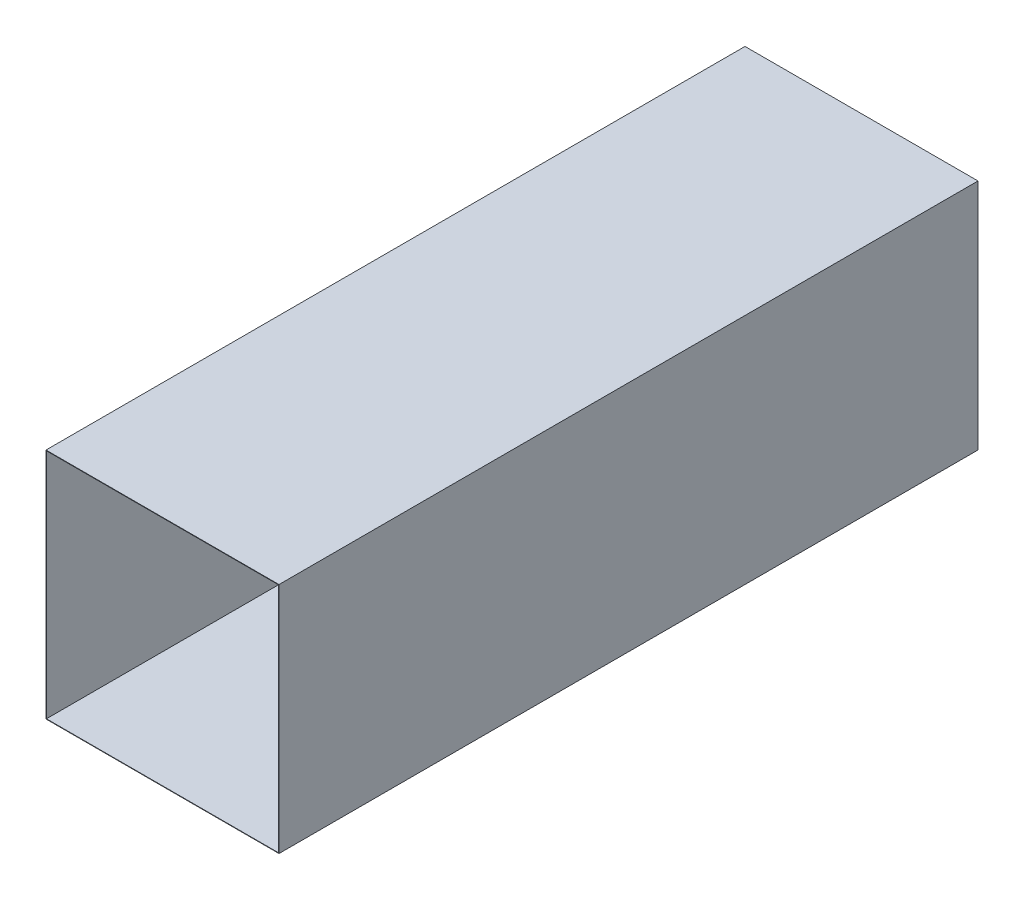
from build123d import *

# Parameters (mm, degrees)
DUCTSKETCH_W    = 1000
DUCTSKETCH_H    = 1000
DUCTSKETCH_W_2  = 996
DUCTSKETCH_H_2  = 996
EXTRUSION_DEPTH = 3000


with BuildPart() as part:
    # DuctSketch → Extrusion (new body)
    with BuildSketch(Plane.XY):
        Rectangle(DUCTSKETCH_W, DUCTSKETCH_H)
        Rectangle(DUCTSKETCH_W_2, DUCTSKETCH_H_2, mode=Mode.SUBTRACT)
    extrude(amount=EXTRUSION_DEPTH)


solid = part.part
